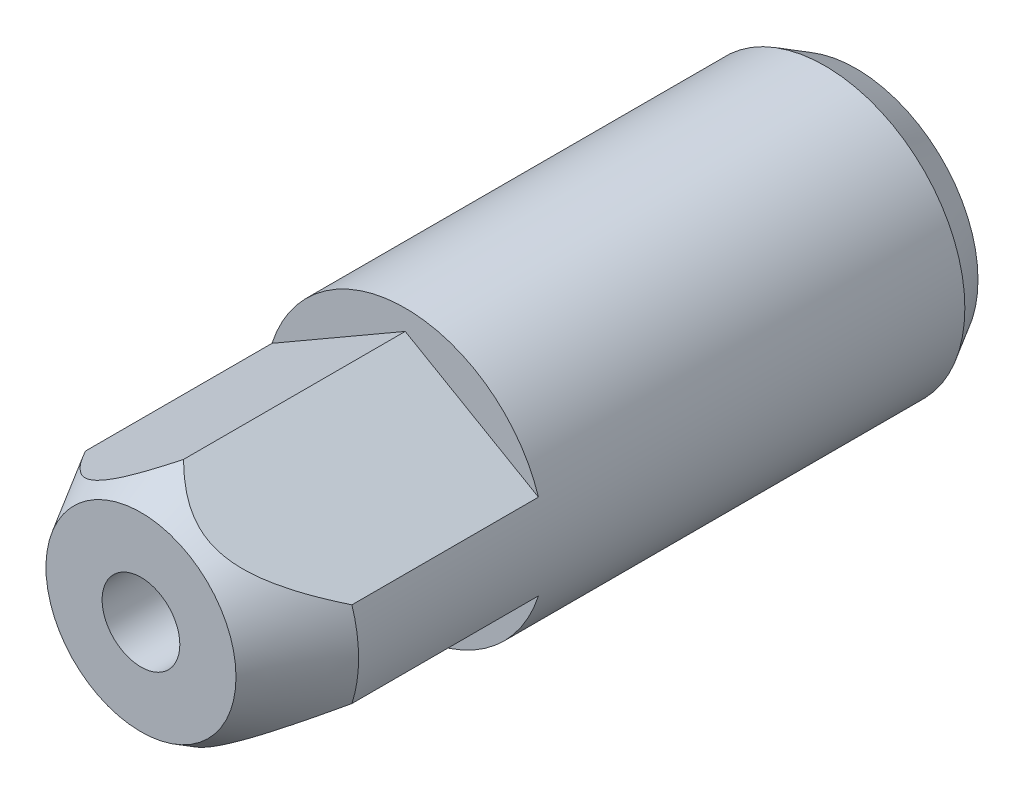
ISO-10303-21;
HEADER;
FILE_DESCRIPTION(('STEP AP214'),'2;1');
FILE_NAME('part.step','',(''),(''),'','','');
FILE_SCHEMA(('AUTOMOTIVE_DESIGN { 1 0 10303 214 1 1 1 1 }'));
ENDSEC;
DATA;
#1=APPLICATION_CONTEXT('core data for automotive mechanical design processes');
#2=APPLICATION_PROTOCOL_DEFINITION('international standard','automotive_design',2000,#1);
#3=PRODUCT_CONTEXT('',#1,'mechanical');
#4=PRODUCT('Part','Part','',(#3));
#5=PRODUCT_RELATED_PRODUCT_CATEGORY('part','',(#4));
#6=PRODUCT_DEFINITION_FORMATION('','',#4);
#7=PRODUCT_DEFINITION_CONTEXT('part definition',#1,'design');
#8=PRODUCT_DEFINITION('design','',#6,#7);
#9=PRODUCT_DEFINITION_SHAPE('','',#8);
#10=(LENGTH_UNIT() NAMED_UNIT(*) SI_UNIT(.MILLI.,.METRE.));
#11=(NAMED_UNIT(*) PLANE_ANGLE_UNIT() SI_UNIT($,.RADIAN.));
#12=(NAMED_UNIT(*) SI_UNIT($,.STERADIAN.) SOLID_ANGLE_UNIT());
#13=UNCERTAINTY_MEASURE_WITH_UNIT(LENGTH_MEASURE(1.E-05),#10,'distance_accuracy_value','');
#14=(GEOMETRIC_REPRESENTATION_CONTEXT(3) GLOBAL_UNCERTAINTY_ASSIGNED_CONTEXT((#13)) GLOBAL_UNIT_ASSIGNED_CONTEXT((#10,
#11,#12)) REPRESENTATION_CONTEXT('',''));
#15=CARTESIAN_POINT('',(0.,0.,0.));
#16=DIRECTION('',(0.,0.,1.));
#17=DIRECTION('',(1.,0.,0.));
#18=AXIS2_PLACEMENT_3D('',#15,#16,#17);
#19=CARTESIAN_POINT('',(0.,0.,41.));
#20=DIRECTION('',(0.,0.,-1.));
#21=DIRECTION('',(-1.,0.,0.));
#22=AXIS2_PLACEMENT_3D('',#19,#20,#21);
#23=CONICAL_SURFACE('',#22,9.,0.523598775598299);
#24=CARTESIAN_POINT('',(0.,0.,46.));
#25=DIRECTION('',(0.,0.,1.));
#26=DIRECTION('',(1.,0.,0.));
#27=AXIS2_PLACEMENT_3D('',#24,#25,#26);
#28=CIRCLE('',#27,6.11324865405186);
#29=CARTESIAN_POINT('',(6.11324865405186,0.,46.));
#30=VERTEX_POINT('',#29);
#31=EDGE_CURVE('E22',#30,#30,#28,.T.);
#32=ORIENTED_EDGE('',*,*,#31,.F.);
#33=EDGE_LOOP('',(#32));
#34=FACE_BOUND('',#33,.T.);
#35=CARTESIAN_POINT('',(-0.000200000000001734,7.69775800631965,43.255549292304));
#36=CARTESIAN_POINT('',(0.0695125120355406,7.65750946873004,43.3252578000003));
#37=CARTESIAN_POINT('',(0.139920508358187,7.61685939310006,43.3940367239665));
#38=CARTESIAN_POINT('',(0.28228050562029,7.53466781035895,43.5294763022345));
#39=CARTESIAN_POINT('',(0.354232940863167,7.49312605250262,43.5961363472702));
#40=CARTESIAN_POINT('',(0.573317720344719,7.3666373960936,43.7931569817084));
#41=CARTESIAN_POINT('',(0.722970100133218,7.28023555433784,43.9198420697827));
#42=CARTESIAN_POINT('',(1.03397800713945,7.10067505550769,44.1634017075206));
#43=CARTESIAN_POINT('',(1.19553740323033,7.0073986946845,44.2799323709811));
#44=CARTESIAN_POINT('',(1.52740980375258,6.81579207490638,44.4944181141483));
#45=CARTESIAN_POINT('',(1.69770236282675,6.71747362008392,44.5924142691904));
#46=CARTESIAN_POINT('',(1.9675893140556,6.56165431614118,44.7248083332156));
#47=CARTESIAN_POINT('',(2.0640232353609,6.50597816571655,44.7678335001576));
#48=CARTESIAN_POINT('',(2.25941662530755,6.39316773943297,44.8455436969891));
#49=CARTESIAN_POINT('',(2.35837627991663,6.33603335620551,44.8802281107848));
#50=CARTESIAN_POINT('',(2.5576408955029,6.22098787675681,44.9399311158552));
#51=CARTESIAN_POINT('',(2.65792902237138,6.16308649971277,44.965023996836));
#52=CARTESIAN_POINT('',(2.86001368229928,6.04641286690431,45.0050230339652));
#53=CARTESIAN_POINT('',(2.96180991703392,5.98764078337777,45.019931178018));
#54=CARTESIAN_POINT('',(3.16714105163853,5.86909279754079,45.0390571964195));
#55=CARTESIAN_POINT('',(3.27068327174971,5.8093126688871,45.0431716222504));
#56=CARTESIAN_POINT('',(3.47764571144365,5.68982284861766,45.0402333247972));
#57=CARTESIAN_POINT('',(3.5810659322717,5.63011315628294,45.0331807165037));
#58=CARTESIAN_POINT('',(3.78708902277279,5.51116566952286,45.0081896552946));
#59=CARTESIAN_POINT('',(3.88969013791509,5.45192888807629,44.9902321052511));
#60=CARTESIAN_POINT('',(4.09315492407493,5.3344584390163,44.944137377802));
#61=CARTESIAN_POINT('',(4.19401833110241,5.27622492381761,44.915998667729));
#62=CARTESIAN_POINT('',(4.42201349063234,5.14459185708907,44.8411566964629));
#63=CARTESIAN_POINT('',(4.54840420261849,5.0716201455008,44.7914453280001));
#64=CARTESIAN_POINT('',(4.79684039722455,4.92818544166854,44.6791593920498));
#65=CARTESIAN_POINT('',(4.91888315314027,4.85772402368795,44.6165769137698));
#66=CARTESIAN_POINT('',(5.15950641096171,4.71880012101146,44.480236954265));
#67=CARTESIAN_POINT('',(5.27804619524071,4.6503611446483,44.4063845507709));
#68=CARTESIAN_POINT('',(5.51065016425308,4.51606718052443,44.2499644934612));
#69=CARTESIAN_POINT('',(5.62471543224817,4.45021156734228,44.1673989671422));
#70=CARTESIAN_POINT('',(5.8754207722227,4.30546677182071,43.9746866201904));
#71=CARTESIAN_POINT('',(6.01096874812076,4.22720811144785,43.8626536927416));
#72=CARTESIAN_POINT('',(6.27655182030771,4.07387365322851,43.6301536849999));
#73=CARTESIAN_POINT('',(6.40658481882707,3.99879906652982,43.5096834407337));
#74=CARTESIAN_POINT('',(6.66215481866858,3.85124565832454,43.2618249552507));
#75=CARTESIAN_POINT('',(6.78767935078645,3.77877403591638,43.1344196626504));
#76=CARTESIAN_POINT('',(7.03455363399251,3.63624110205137,42.8743200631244));
#77=CARTESIAN_POINT('',(7.15590293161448,3.56618005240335,42.7416251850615));
#78=CARTESIAN_POINT('',(7.3891638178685,3.43150681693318,42.4785429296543));
#79=CARTESIAN_POINT('',(7.50124722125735,3.36679543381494,42.348357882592));
#80=CARTESIAN_POINT('',(7.72256910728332,3.23901518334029,42.0847929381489));
#81=CARTESIAN_POINT('',(7.83180739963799,3.1759464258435,41.9514128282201));
#82=CARTESIAN_POINT('',(8.04707385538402,3.05166227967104,41.6828894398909));
#83=CARTESIAN_POINT('',(8.15311851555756,2.99043736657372,41.547763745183));
#84=CARTESIAN_POINT('',(8.36301184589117,2.86925539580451,41.2753094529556));
#85=CARTESIAN_POINT('',(8.46686100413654,2.80929805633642,41.1379813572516));
#86=CARTESIAN_POINT('',(8.56976825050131,2.74988452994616,40.9997312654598));
#87=B_SPLINE_CURVE_WITH_KNOTS('',3,(#35,#36,#37,#38,#39,#40,#41,#42,#43,#44,#45,#46,#47,#48,#49,
#50,#51,#52,#53,#54,#55,#56,#57,#58,#59,#60,#61,#62,#63,#64,#65,#66,#67,#68,#69,#70,#71,#72,#73,
#74,#75,#76,#77,#78,#79,#80,#81,#82,#83,#84,#85,#86),.UNSPECIFIED.,.F.,.F.,(4,2,2,2,2,2,2,2,2,2,
2,2,2,2,2,2,2,2,2,2,2,2,2,2,2,4),(0.,0.319440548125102,0.638972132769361,1.28128977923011,
1.94043178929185,2.59809546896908,2.95595095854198,3.31383287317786,3.66888381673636,
4.02386543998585,4.38223703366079,4.74060493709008,5.09960224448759,5.45865361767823,
5.92043439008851,6.38249983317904,6.8486970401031,7.314780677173,7.8918478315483,
8.46913255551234,9.04790711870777,9.62674434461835,10.1773925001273,10.7280773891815,
11.2751064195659,11.8220125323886),.UNSPECIFIED.);
#88=CARTESIAN_POINT('',(0.,7.69764253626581,43.2557492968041));
#89=VERTEX_POINT('',#88);
#90=CARTESIAN_POINT('',(8.56956825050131,2.75,41.));
#91=VERTEX_POINT('',#90);
#92=EDGE_CURVE('E101',#89,#91,#87,.T.);
#93=ORIENTED_EDGE('',*,*,#92,.F.);
#94=CARTESIAN_POINT('',(0.000199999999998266,7.69775800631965,43.255549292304));
#95=CARTESIAN_POINT('',(-0.0695125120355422,7.65750946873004,43.3252578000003));
#96=CARTESIAN_POINT('',(-0.139920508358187,7.61685939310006,43.3940367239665));
#97=CARTESIAN_POINT('',(-0.282280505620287,7.53466781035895,43.5294763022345));
#98=CARTESIAN_POINT('',(-0.354232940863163,7.49312605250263,43.5961363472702));
#99=CARTESIAN_POINT('',(-0.573317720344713,7.3666373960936,43.7931569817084));
#100=CARTESIAN_POINT('',(-0.722970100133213,7.28023555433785,43.9198420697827));
#101=CARTESIAN_POINT('',(-1.03397800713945,7.10067505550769,44.1634017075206));
#102=CARTESIAN_POINT('',(-1.19553740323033,7.0073986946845,44.2799323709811));
#103=CARTESIAN_POINT('',(-1.52740980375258,6.81579207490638,44.4944181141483));
#104=CARTESIAN_POINT('',(-1.69770236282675,6.71747362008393,44.5924142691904));
#105=CARTESIAN_POINT('',(-1.96758931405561,6.56165431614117,44.7248083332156));
#106=CARTESIAN_POINT('',(-2.06402323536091,6.50597816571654,44.7678335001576));
#107=CARTESIAN_POINT('',(-2.25941662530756,6.39316773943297,44.8455436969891));
#108=CARTESIAN_POINT('',(-2.35837627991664,6.3360333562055,44.8802281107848));
#109=CARTESIAN_POINT('',(-2.55764089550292,6.2209878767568,44.9399311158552));
#110=CARTESIAN_POINT('',(-2.65792902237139,6.16308649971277,44.965023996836));
#111=CARTESIAN_POINT('',(-2.86001368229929,6.0464128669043,45.0050230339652));
#112=CARTESIAN_POINT('',(-2.96180991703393,5.98764078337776,45.019931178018));
#113=CARTESIAN_POINT('',(-3.16714105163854,5.86909279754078,45.0390571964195));
#114=CARTESIAN_POINT('',(-3.27068327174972,5.80931266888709,45.0431716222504));
#115=CARTESIAN_POINT('',(-3.47764571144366,5.68982284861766,45.0402333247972));
#116=CARTESIAN_POINT('',(-3.58106593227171,5.63011315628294,45.0331807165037));
#117=CARTESIAN_POINT('',(-3.7870890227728,5.51116566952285,45.0081896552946));
#118=CARTESIAN_POINT('',(-3.8896901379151,5.45192888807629,44.9902321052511));
#119=CARTESIAN_POINT('',(-4.09315492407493,5.3344584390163,44.944137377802));
#120=CARTESIAN_POINT('',(-4.19401833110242,5.2762249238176,44.915998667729));
#121=CARTESIAN_POINT('',(-4.42201349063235,5.14459185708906,44.8411566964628));
#122=CARTESIAN_POINT('',(-4.54840420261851,5.07162014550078,44.7914453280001));
#123=CARTESIAN_POINT('',(-4.79684039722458,4.92818544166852,44.6791593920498));
#124=CARTESIAN_POINT('',(-4.9188831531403,4.85772402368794,44.6165769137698));
#125=CARTESIAN_POINT('',(-5.15950641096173,4.71880012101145,44.480236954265));
#126=CARTESIAN_POINT('',(-5.27804619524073,4.65036114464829,44.4063845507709));
#127=CARTESIAN_POINT('',(-5.5106501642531,4.51606718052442,44.2499644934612));
#128=CARTESIAN_POINT('',(-5.62471543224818,4.45021156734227,44.1673989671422));
#129=CARTESIAN_POINT('',(-5.8754207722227,4.30546677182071,43.9746866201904));
#130=CARTESIAN_POINT('',(-6.01096874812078,4.22720811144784,43.8626536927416));
#131=CARTESIAN_POINT('',(-6.27655182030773,4.0738736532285,43.6301536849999));
#132=CARTESIAN_POINT('',(-6.40658481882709,3.99879906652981,43.5096834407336));
#133=CARTESIAN_POINT('',(-6.66215481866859,3.85124565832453,43.2618249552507));
#134=CARTESIAN_POINT('',(-6.78767935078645,3.77877403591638,43.1344196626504));
#135=CARTESIAN_POINT('',(-7.03455363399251,3.63624110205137,42.8743200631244));
#136=CARTESIAN_POINT('',(-7.15590293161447,3.56618005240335,42.7416251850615));
#137=CARTESIAN_POINT('',(-7.3891638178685,3.43150681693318,42.4785429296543));
#138=CARTESIAN_POINT('',(-7.50124722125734,3.36679543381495,42.348357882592));
#139=CARTESIAN_POINT('',(-7.7225691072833,3.2390151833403,42.0847929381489));
#140=CARTESIAN_POINT('',(-7.83180739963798,3.17594642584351,41.9514128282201));
#141=CARTESIAN_POINT('',(-8.04707385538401,3.05166227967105,41.6828894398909));
#142=CARTESIAN_POINT('',(-8.15311851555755,2.99043736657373,41.547763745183));
#143=CARTESIAN_POINT('',(-8.36301184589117,2.86925539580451,41.2753094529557));
#144=CARTESIAN_POINT('',(-8.46686100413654,2.80929805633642,41.1379813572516));
#145=CARTESIAN_POINT('',(-8.56976825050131,2.74988452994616,40.9997312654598));
#146=B_SPLINE_CURVE_WITH_KNOTS('',3,(#94,#95,#96,#97,#98,#99,#100,#101,#102,#103,#104,#105,#106,
#107,#108,#109,#110,#111,#112,#113,#114,#115,#116,#117,#118,#119,#120,#121,#122,#123,#124,#125,
#126,#127,#128,#129,#130,#131,#132,#133,#134,#135,#136,#137,#138,#139,#140,#141,#142,#143,#144,
#145),.UNSPECIFIED.,.F.,.F.,(4,2,2,2,2,2,2,2,2,2,2,2,2,2,2,2,2,2,2,2,2,2,2,2,2,4),(0.,
0.319440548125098,0.638972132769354,1.28128977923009,1.94043178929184,2.59809546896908,
2.95595095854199,3.31383287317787,3.66888381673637,4.02386543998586,4.3822370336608,
4.74060493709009,5.0996022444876,5.45865361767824,5.92043439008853,6.38249983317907,
6.84869704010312,7.31478067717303,7.89184783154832,8.46913255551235,9.04790711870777,
9.62674434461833,10.1773925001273,10.7280773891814,11.2751064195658,11.8220125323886),.UNSPECIFIED.);
#147=CARTESIAN_POINT('',(-8.56956825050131,2.75,41.));
#148=VERTEX_POINT('',#147);
#149=EDGE_CURVE('E74',#89,#148,#146,.T.);
#150=ORIENTED_EDGE('',*,*,#149,.T.);
#151=CARTESIAN_POINT('',(0.,0.,41.));
#152=DIRECTION('',(0.,0.,1.));
#153=DIRECTION('',(1.,0.,0.));
#154=AXIS2_PLACEMENT_3D('',#151,#152,#153);
#155=CIRCLE('',#154,9.);
#156=CARTESIAN_POINT('',(-8.56956825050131,-2.75,41.));
#157=VERTEX_POINT('',#156);
#158=EDGE_CURVE('E154',#148,#157,#155,.T.);
#159=ORIENTED_EDGE('',*,*,#158,.T.);
#160=CARTESIAN_POINT('',(0.000199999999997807,-7.69775800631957,43.2555492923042));
#161=CARTESIAN_POINT('',(-0.0695125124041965,-7.65750946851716,43.3252578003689));
#162=CARTESIAN_POINT('',(-0.139920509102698,-7.61685939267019,43.3940367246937));
#163=CARTESIAN_POINT('',(-0.28228050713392,-7.53466780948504,43.5294763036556));
#164=CARTESIAN_POINT('',(-0.354232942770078,-7.49312605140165,43.5961363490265));
#165=CARTESIAN_POINT('',(-0.573317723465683,-7.36663739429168,43.7931569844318));
#166=CARTESIAN_POINT('',(-0.722970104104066,-7.28023555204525,43.9198420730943));
#167=CARTESIAN_POINT('',(-1.033978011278,-7.10067505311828,44.1634017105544));
#168=CARTESIAN_POINT('',(-1.19553740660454,-7.0073986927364,44.2799323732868));
#169=CARTESIAN_POINT('',(-1.52740980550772,-6.81579207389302,44.4944181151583));
#170=CARTESIAN_POINT('',(-1.69770236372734,-6.7174736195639,44.5924142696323));
#171=CARTESIAN_POINT('',(-1.96758931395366,-6.56165431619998,44.7248083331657));
#172=CARTESIAN_POINT('',(-2.06402323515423,-6.50597816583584,44.7678335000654));
#173=CARTESIAN_POINT('',(-2.25941662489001,-6.39316773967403,44.8455436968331));
#174=CARTESIAN_POINT('',(-2.35837627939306,-6.33603335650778,44.8802281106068));
#175=CARTESIAN_POINT('',(-2.5576408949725,-6.22098787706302,44.9399311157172));
#176=CARTESIAN_POINT('',(-2.6579290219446,-6.16308649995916,44.9650239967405));
#177=CARTESIAN_POINT('',(-2.86001368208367,-6.04641286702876,45.0050230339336));
#178=CARTESIAN_POINT('',(-2.96180991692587,-5.98764078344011,45.019931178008));
#179=CARTESIAN_POINT('',(-3.16714105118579,-5.86909279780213,45.0390571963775));
#180=CARTESIAN_POINT('',(-3.27068327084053,-5.809312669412,45.0431716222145));
#181=CARTESIAN_POINT('',(-3.47764570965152,-5.68982284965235,45.0402333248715));
#182=CARTESIAN_POINT('',(-3.58106593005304,-5.63011315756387,45.0331807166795));
#183=CARTESIAN_POINT('',(-3.78708902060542,-5.51116567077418,45.008189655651));
#184=CARTESIAN_POINT('',(-3.88969013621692,-5.45192888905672,44.9902321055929));
#185=CARTESIAN_POINT('',(-4.09315492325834,-5.33445843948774,44.94413737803));
#186=CARTESIAN_POINT('',(-4.19401833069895,-5.27622492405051,44.9159986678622));
#187=CARTESIAN_POINT('',(-4.42201349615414,-5.14459185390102,44.8411566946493));
#188=CARTESIAN_POINT('',(-4.54840421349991,-5.07162013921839,44.7914453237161));
#189=CARTESIAN_POINT('',(-4.79684041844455,-4.92818542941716,44.6791593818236));
#190=CARTESIAN_POINT('',(-4.91888317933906,-4.85772400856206,44.6165769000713));
#191=CARTESIAN_POINT('',(-5.15950643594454,-4.71880010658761,44.4802369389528));
#192=CARTESIAN_POINT('',(-5.27804621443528,-4.65036113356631,44.406384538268));
#193=CARTESIAN_POINT('',(-5.51065017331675,-4.51606717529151,44.2499644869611));
#194=CARTESIAN_POINT('',(-5.62471543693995,-4.45021156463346,44.1673989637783));
#195=CARTESIAN_POINT('',(-5.87541789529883,-4.30546843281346,43.9746888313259));
#196=CARTESIAN_POINT('',(-6.01096312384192,-4.22721135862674,43.8626583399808));
#197=CARTESIAN_POINT('',(-6.27654091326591,-4.07387995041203,43.6301635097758));
#198=CARTESIAN_POINT('',(-6.40657137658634,-3.99880682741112,43.5096960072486));
#199=CARTESIAN_POINT('',(-6.66213645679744,-3.85125625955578,43.261843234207));
#200=CARTESIAN_POINT('',(-6.7876586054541,-3.77878601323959,43.1344409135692));
#201=CARTESIAN_POINT('',(-7.03452825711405,-3.63625575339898,42.8743474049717));
#202=CARTESIAN_POINT('',(-7.15587530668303,-3.56619600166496,42.7416556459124));
#203=CARTESIAN_POINT('',(-7.3891320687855,-3.43152514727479,42.478579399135));
#204=CARTESIAN_POINT('',(-7.501213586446,-3.36681485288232,42.3483972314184));
#205=CARTESIAN_POINT('',(-7.72253177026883,-3.23903673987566,42.0848381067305));
#206=CARTESIAN_POINT('',(-7.83176824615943,-3.17596903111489,41.951460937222));
#207=CARTESIAN_POINT('',(-8.04703116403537,-3.05168692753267,41.6829434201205));
#208=CARTESIAN_POINT('',(-8.15307410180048,-2.99046300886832,41.5478206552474));
#209=CARTESIAN_POINT('',(-8.3629640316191,-2.86928300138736,41.2753722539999));
#210=CARTESIAN_POINT('',(-8.46681151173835,-2.80932663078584,41.1380471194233));
#211=CARTESIAN_POINT('',(-8.56971709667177,-2.74991406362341,40.9998));
#212=B_SPLINE_CURVE_WITH_KNOTS('',3,(#160,#161,#162,#163,#164,#165,#166,#167,#168,#169,#170,
#171,#172,#173,#174,#175,#176,#177,#178,#179,#180,#181,#182,#183,#184,#185,#186,#187,#188,#189,
#190,#191,#192,#193,#194,#195,#196,#197,#198,#199,#200,#201,#202,#203,#204,#205,#206,#207,#208,
#209,#210,#211),.UNSPECIFIED.,.F.,.F.,(4,2,2,2,2,2,2,2,2,2,2,2,2,2,2,2,2,2,2,2,2,2,2,2,2,4),(0.,
0.319440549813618,0.638972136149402,1.28128978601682,1.94043179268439,2.59809546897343,
2.955950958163,3.3138328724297,3.66888381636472,4.02386543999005,4.38223703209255,
4.74060493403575,5.09960224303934,5.45865361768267,5.92043440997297,6.38249987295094,
6.84869705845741,7.31478067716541,7.89183586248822,8.4691085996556,9.04787108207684,
9.62669622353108,10.177333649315,10.7280078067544,11.2750263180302,11.821921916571),.UNSPECIFIED.);
#213=CARTESIAN_POINT('',(0.,-7.69764253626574,43.2557492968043));
#214=VERTEX_POINT('',#213);
#215=EDGE_CURVE('E128',#214,#157,#212,.T.);
#216=ORIENTED_EDGE('',*,*,#215,.F.);
#217=CARTESIAN_POINT('',(-0.000200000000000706,-7.69775800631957,43.2555492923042));
#218=CARTESIAN_POINT('',(0.0695125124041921,-7.65750946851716,43.3252578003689));
#219=CARTESIAN_POINT('',(0.139920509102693,-7.61685939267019,43.3940367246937));
#220=CARTESIAN_POINT('',(0.282280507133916,-7.53466780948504,43.5294763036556));
#221=CARTESIAN_POINT('',(0.354232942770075,-7.49312605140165,43.5961363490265));
#222=CARTESIAN_POINT('',(0.573317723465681,-7.36663739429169,43.7931569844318));
#223=CARTESIAN_POINT('',(0.722970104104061,-7.28023555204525,43.9198420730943));
#224=CARTESIAN_POINT('',(1.03397801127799,-7.10067505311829,44.1634017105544));
#225=CARTESIAN_POINT('',(1.19553740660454,-7.0073986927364,44.2799323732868));
#226=CARTESIAN_POINT('',(1.52740980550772,-6.81579207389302,44.4944181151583));
#227=CARTESIAN_POINT('',(1.69770236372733,-6.71747361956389,44.5924142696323));
#228=CARTESIAN_POINT('',(1.96758931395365,-6.56165431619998,44.7248083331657));
#229=CARTESIAN_POINT('',(2.06402323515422,-6.50597816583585,44.7678335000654));
#230=CARTESIAN_POINT('',(2.25941662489,-6.39316773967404,44.8455436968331));
#231=CARTESIAN_POINT('',(2.35837627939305,-6.33603335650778,44.8802281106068));
#232=CARTESIAN_POINT('',(2.55764089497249,-6.22098787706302,44.9399311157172));
#233=CARTESIAN_POINT('',(2.65792902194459,-6.16308649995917,44.9650239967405));
#234=CARTESIAN_POINT('',(2.86001368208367,-6.04641286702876,45.0050230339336));
#235=CARTESIAN_POINT('',(2.96180991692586,-5.98764078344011,45.019931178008));
#236=CARTESIAN_POINT('',(3.16714105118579,-5.86909279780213,45.0390571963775));
#237=CARTESIAN_POINT('',(3.27068327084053,-5.809312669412,45.0431716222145));
#238=CARTESIAN_POINT('',(3.47764570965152,-5.68982284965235,45.0402333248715));
#239=CARTESIAN_POINT('',(3.58106593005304,-5.63011315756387,45.0331807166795));
#240=CARTESIAN_POINT('',(3.78708902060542,-5.51116567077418,45.008189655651));
#241=CARTESIAN_POINT('',(3.88969013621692,-5.45192888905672,44.9902321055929));
#242=CARTESIAN_POINT('',(4.09315492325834,-5.33445843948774,44.94413737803));
#243=CARTESIAN_POINT('',(4.19401833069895,-5.27622492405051,44.9159986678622));
#244=CARTESIAN_POINT('',(4.42201349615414,-5.14459185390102,44.8411566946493));
#245=CARTESIAN_POINT('',(4.5484042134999,-5.07162013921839,44.7914453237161));
#246=CARTESIAN_POINT('',(4.79684041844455,-4.92818542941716,44.6791593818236));
#247=CARTESIAN_POINT('',(4.91888317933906,-4.85772400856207,44.6165769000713));
#248=CARTESIAN_POINT('',(5.15950643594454,-4.71880010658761,44.4802369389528));
#249=CARTESIAN_POINT('',(5.27804621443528,-4.65036113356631,44.406384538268));
#250=CARTESIAN_POINT('',(5.51065017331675,-4.51606717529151,44.2499644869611));
#251=CARTESIAN_POINT('',(5.62471543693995,-4.45021156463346,44.1673989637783));
#252=CARTESIAN_POINT('',(5.87541789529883,-4.30546843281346,43.9746888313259));
#253=CARTESIAN_POINT('',(6.01096312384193,-4.22721135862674,43.8626583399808));
#254=CARTESIAN_POINT('',(6.27654091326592,-4.07387995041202,43.6301635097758));
#255=CARTESIAN_POINT('',(6.40657137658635,-3.99880682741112,43.5096960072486));
#256=CARTESIAN_POINT('',(6.66213645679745,-3.85125625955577,43.261843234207));
#257=CARTESIAN_POINT('',(6.78765860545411,-3.77878601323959,43.1344409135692));
#258=CARTESIAN_POINT('',(7.03452825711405,-3.63625575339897,42.8743474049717));
#259=CARTESIAN_POINT('',(7.15587530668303,-3.56619600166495,42.7416556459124));
#260=CARTESIAN_POINT('',(7.38913206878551,-3.43152514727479,42.478579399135));
#261=CARTESIAN_POINT('',(7.501213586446,-3.36681485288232,42.3483972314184));
#262=CARTESIAN_POINT('',(7.72253177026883,-3.23903673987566,42.0848381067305));
#263=CARTESIAN_POINT('',(7.83176824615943,-3.17596903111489,41.951460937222));
#264=CARTESIAN_POINT('',(8.04703116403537,-3.05168692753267,41.6829434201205));
#265=CARTESIAN_POINT('',(8.15307410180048,-2.99046300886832,41.5478206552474));
#266=CARTESIAN_POINT('',(8.3629640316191,-2.86928300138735,41.2753722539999));
#267=CARTESIAN_POINT('',(8.46681151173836,-2.80932663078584,41.1380471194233));
#268=CARTESIAN_POINT('',(8.56971709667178,-2.74991406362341,40.9998));
#269=B_SPLINE_CURVE_WITH_KNOTS('',3,(#217,#218,#219,#220,#221,#222,#223,#224,#225,#226,#227,
#228,#229,#230,#231,#232,#233,#234,#235,#236,#237,#238,#239,#240,#241,#242,#243,#244,#245,#246,
#247,#248,#249,#250,#251,#252,#253,#254,#255,#256,#257,#258,#259,#260,#261,#262,#263,#264,#265,
#266,#267,#268),.UNSPECIFIED.,.F.,.F.,(4,2,2,2,2,2,2,2,2,2,2,2,2,2,2,2,2,2,2,2,2,2,2,2,2,4),(0.,
0.31944054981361,0.638972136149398,1.28128978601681,1.94043179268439,2.59809546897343,
2.95595095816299,3.3138328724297,3.66888381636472,4.02386543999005,4.38223703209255,
4.74060493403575,5.09960224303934,5.45865361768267,5.92043440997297,6.38249987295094,
6.84869705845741,7.31478067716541,7.89183586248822,8.46910859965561,9.04787108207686,
9.62669622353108,10.177333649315,10.7280078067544,11.2750263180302,11.821921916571),.UNSPECIFIED.);
#270=CARTESIAN_POINT('',(8.56956825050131,-2.75,41.));
#271=VERTEX_POINT('',#270);
#272=EDGE_CURVE('E137',#214,#271,#269,.T.);
#273=ORIENTED_EDGE('',*,*,#272,.T.);
#274=EDGE_CURVE('E155',#271,#91,#155,.T.);
#275=ORIENTED_EDGE('',*,*,#274,.T.);
#276=EDGE_LOOP('',(#93,#150,#159,#216,#273,#275));
#277=FACE_BOUND('',#276,.T.);
#278=ADVANCED_FACE('F14',(#34,#277),#23,.T.);
#279=CARTESIAN_POINT('',(0.,0.,30.));
#280=DIRECTION('',(0.,0.,1.));
#281=DIRECTION('',(1.,0.,0.));
#282=AXIS2_PLACEMENT_3D('',#279,#280,#281);
#283=CYLINDRICAL_SURFACE('',#282,9.);
#284=CARTESIAN_POINT('',(0.,0.,2.));
#285=DIRECTION('',(0.,0.,1.));
#286=DIRECTION('',(1.,0.,0.));
#287=AXIS2_PLACEMENT_3D('',#284,#285,#286);
#288=CIRCLE('',#287,9.);
#289=CARTESIAN_POINT('',(9.,0.,2.));
#290=VERTEX_POINT('',#289);
#291=EDGE_CURVE('E151',#290,#290,#288,.T.);
#292=ORIENTED_EDGE('',*,*,#291,.T.);
#293=EDGE_LOOP('',(#292));
#294=FACE_BOUND('',#293,.T.);
#295=DIRECTION('',(0.,0.,1.));
#296=VECTOR('',#295,1.);
#297=CARTESIAN_POINT('',(8.56956825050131,2.75,29.));
#298=LINE('',#297,#296);
#299=CARTESIAN_POINT('',(8.5695682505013,2.75,29.));
#300=VERTEX_POINT('',#299);
#301=EDGE_CURVE('E81',#300,#91,#298,.T.);
#302=ORIENTED_EDGE('',*,*,#301,.T.);
#303=ORIENTED_EDGE('',*,*,#274,.F.);
#304=DIRECTION('',(0.,0.,1.));
#305=VECTOR('',#304,1.);
#306=CARTESIAN_POINT('',(8.56956825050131,-2.75,29.));
#307=LINE('',#306,#305);
#308=CARTESIAN_POINT('',(8.56956825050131,-2.75,29.));
#309=VERTEX_POINT('',#308);
#310=EDGE_CURVE('E178',#309,#271,#307,.T.);
#311=ORIENTED_EDGE('',*,*,#310,.F.);
#312=CARTESIAN_POINT('',(0.,0.,29.));
#313=DIRECTION('',(0.,0.,1.));
#314=DIRECTION('',(1.,0.,0.));
#315=AXIS2_PLACEMENT_3D('',#312,#313,#314);
#316=CIRCLE('',#315,9.);
#317=CARTESIAN_POINT('',(-8.5695682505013,-2.75,29.));
#318=VERTEX_POINT('',#317);
#319=EDGE_CURVE('E168',#318,#309,#316,.T.);
#320=ORIENTED_EDGE('',*,*,#319,.F.);
#321=DIRECTION('',(0.,0.,1.));
#322=VECTOR('',#321,1.);
#323=CARTESIAN_POINT('',(-8.56956825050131,-2.75,29.));
#324=LINE('',#323,#322);
#325=EDGE_CURVE('E175',#318,#157,#324,.T.);
#326=ORIENTED_EDGE('',*,*,#325,.T.);
#327=ORIENTED_EDGE('',*,*,#158,.F.);
#328=DIRECTION('',(0.,0.,1.));
#329=VECTOR('',#328,1.);
#330=CARTESIAN_POINT('',(-8.56956825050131,2.75,29.));
#331=LINE('',#330,#329);
#332=CARTESIAN_POINT('',(-8.56956825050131,2.75,29.));
#333=VERTEX_POINT('',#332);
#334=EDGE_CURVE('E77',#333,#148,#331,.T.);
#335=ORIENTED_EDGE('',*,*,#334,.F.);
#336=CARTESIAN_POINT('',(0.,0.,29.));
#337=DIRECTION('',(0.,0.,1.));
#338=DIRECTION('',(1.,0.,0.));
#339=AXIS2_PLACEMENT_3D('',#336,#337,#338);
#340=CIRCLE('',#339,9.);
#341=EDGE_CURVE('E85',#300,#333,#340,.T.);
#342=ORIENTED_EDGE('',*,*,#341,.F.);
#343=EDGE_LOOP('',(#302,#303,#311,#320,#326,#327,#335,#342));
#344=FACE_BOUND('',#343,.T.);
#345=ADVANCED_FACE('F164',(#294,#344),#283,.T.);
#346=CARTESIAN_POINT('',(0.,0.,30.));
#347=DIRECTION('',(0.,0.,1.));
#348=DIRECTION('',(1.,0.,0.));
#349=AXIS2_PLACEMENT_3D('',#346,#347,#348);
#350=CYLINDRICAL_SURFACE('',#349,2.5);
#351=CARTESIAN_POINT('',(0.,0.,36.));
#352=DIRECTION('',(0.,0.,1.));
#353=DIRECTION('',(1.,0.,0.));
#354=AXIS2_PLACEMENT_3D('',#351,#352,#353);
#355=CIRCLE('',#354,2.5);
#356=CARTESIAN_POINT('',(2.5,0.,36.));
#357=VERTEX_POINT('',#356);
#358=EDGE_CURVE('E88',#357,#357,#355,.T.);
#359=ORIENTED_EDGE('',*,*,#358,.F.);
#360=EDGE_LOOP('',(#359));
#361=FACE_BOUND('',#360,.T.);
#362=CARTESIAN_POINT('',(0.,0.,46.));
#363=DIRECTION('',(0.,0.,1.));
#364=DIRECTION('',(1.,0.,0.));
#365=AXIS2_PLACEMENT_3D('',#362,#363,#364);
#366=CIRCLE('',#365,2.5);
#367=CARTESIAN_POINT('',(2.5,0.,46.));
#368=VERTEX_POINT('',#367);
#369=EDGE_CURVE('E9',#368,#368,#366,.T.);
#370=ORIENTED_EDGE('',*,*,#369,.T.);
#371=EDGE_LOOP('',(#370));
#372=FACE_BOUND('',#371,.T.);
#373=ADVANCED_FACE('F16',(#361,#372),#350,.F.);
#374=CARTESIAN_POINT('',(6.11324865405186,0.,46.));
#375=DIRECTION('',(0.,0.,-1.));
#376=DIRECTION('',(-1.,0.,0.));
#377=AXIS2_PLACEMENT_3D('',#374,#375,#376);
#378=PLANE('',#377);
#379=ORIENTED_EDGE('',*,*,#369,.F.);
#380=EDGE_LOOP('',(#379));
#381=FACE_BOUND('',#380,.T.);
#382=ORIENTED_EDGE('',*,*,#31,.T.);
#383=EDGE_LOOP('',(#382));
#384=FACE_BOUND('',#383,.T.);
#385=ADVANCED_FACE('F160',(#381,#384),#378,.F.);
#386=CARTESIAN_POINT('',(0.,0.,0.));
#387=DIRECTION('',(0.,0.,1.));
#388=DIRECTION('',(1.,0.,0.));
#389=AXIS2_PLACEMENT_3D('',#386,#387,#388);
#390=CONICAL_SURFACE('',#389,7.84529946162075,0.523598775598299);
#391=ORIENTED_EDGE('',*,*,#291,.F.);
#392=EDGE_LOOP('',(#391));
#393=FACE_BOUND('',#392,.T.);
#394=CARTESIAN_POINT('',(0.,0.,0.));
#395=DIRECTION('',(0.,0.,1.));
#396=DIRECTION('',(1.,0.,0.));
#397=AXIS2_PLACEMENT_3D('',#394,#395,#396);
#398=CIRCLE('',#397,7.84529946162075);
#399=CARTESIAN_POINT('',(7.84529946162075,0.,0.));
#400=VERTEX_POINT('',#399);
#401=EDGE_CURVE('E148',#400,#400,#398,.T.);
#402=ORIENTED_EDGE('',*,*,#401,.T.);
#403=EDGE_LOOP('',(#402));
#404=FACE_BOUND('',#403,.T.);
#405=ADVANCED_FACE('F251',(#393,#404),#390,.T.);
#406=CARTESIAN_POINT('',(1.,0.,0.));
#407=DIRECTION('',(0.,0.,1.));
#408=DIRECTION('',(1.,0.,0.));
#409=AXIS2_PLACEMENT_3D('',#406,#407,#408);
#410=PLANE('',#409);
#411=ORIENTED_EDGE('',*,*,#401,.F.);
#412=EDGE_LOOP('',(#411));
#413=FACE_BOUND('',#412,.T.);
#414=CARTESIAN_POINT('',(0.,0.,0.));
#415=DIRECTION('',(0.,0.,1.));
#416=DIRECTION('',(1.,0.,0.));
#417=AXIS2_PLACEMENT_3D('',#414,#415,#416);
#418=CIRCLE('',#417,1.);
#419=CARTESIAN_POINT('',(1.,0.,0.));
#420=VERTEX_POINT('',#419);
#421=EDGE_CURVE('E145',#420,#420,#418,.T.);
#422=ORIENTED_EDGE('',*,*,#421,.T.);
#423=EDGE_LOOP('',(#422));
#424=FACE_BOUND('',#423,.T.);
#425=ADVANCED_FACE('F256',(#413,#424),#410,.F.);
#426=CARTESIAN_POINT('',(0.,0.,30.));
#427=DIRECTION('',(0.,0.,1.));
#428=DIRECTION('',(1.,0.,0.));
#429=AXIS2_PLACEMENT_3D('',#426,#427,#428);
#430=CYLINDRICAL_SURFACE('',#429,1.);
#431=ORIENTED_EDGE('',*,*,#421,.F.);
#432=EDGE_LOOP('',(#431));
#433=FACE_BOUND('',#432,.T.);
#434=CARTESIAN_POINT('',(0.,0.,4.));
#435=DIRECTION('',(0.,0.,1.));
#436=DIRECTION('',(1.,0.,0.));
#437=AXIS2_PLACEMENT_3D('',#434,#435,#436);
#438=CIRCLE('',#437,1.);
#439=CARTESIAN_POINT('',(1.,0.,4.));
#440=VERTEX_POINT('',#439);
#441=EDGE_CURVE('E136',#440,#440,#438,.T.);
#442=ORIENTED_EDGE('',*,*,#441,.T.);
#443=EDGE_LOOP('',(#442));
#444=FACE_BOUND('',#443,.T.);
#445=ADVANCED_FACE('F265',(#433,#444),#430,.F.);
#446=CARTESIAN_POINT('',(0.,0.,4.));
#447=DIRECTION('',(0.,0.,1.));
#448=DIRECTION('',(1.,0.,0.));
#449=AXIS2_PLACEMENT_3D('',#446,#447,#448);
#450=PLANE('',#449);
#451=ORIENTED_EDGE('',*,*,#441,.F.);
#452=EDGE_LOOP('',(#451));
#453=FACE_BOUND('',#452,.T.);
#454=ADVANCED_FACE('F123',(#453),#450,.F.);
#455=CARTESIAN_POINT('',(-8.56956825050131,-2.75,29.));
#456=DIRECTION('',(-0.5,-0.866025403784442,0.));
#457=DIRECTION('',(0.866025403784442,-0.5,0.));
#458=AXIS2_PLACEMENT_3D('',#455,#456,#457);
#459=PLANE('',#458);
#460=ORIENTED_EDGE('',*,*,#215,.T.);
#461=ORIENTED_EDGE('',*,*,#325,.F.);
#462=DIRECTION('',(0.866025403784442,-0.5,0.));
#463=VECTOR('',#462,1.);
#464=CARTESIAN_POINT('',(-8.56956825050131,-2.75,29.));
#465=LINE('',#464,#463);
#466=CARTESIAN_POINT('',(0.,-7.69764253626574,29.));
#467=VERTEX_POINT('',#466);
#468=EDGE_CURVE('E37',#318,#467,#465,.T.);
#469=ORIENTED_EDGE('',*,*,#468,.T.);
#470=DIRECTION('',(0.,0.,1.));
#471=VECTOR('',#470,1.);
#472=CARTESIAN_POINT('',(0.,-7.69764253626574,29.));
#473=LINE('',#472,#471);
#474=EDGE_CURVE('E179',#467,#214,#473,.T.);
#475=ORIENTED_EDGE('',*,*,#474,.T.);
#476=EDGE_LOOP('',(#460,#461,#469,#475));
#477=FACE_BOUND('',#476,.T.);
#478=ADVANCED_FACE('F119',(#477),#459,.T.);
#479=CARTESIAN_POINT('',(8.56956825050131,-2.75,29.));
#480=DIRECTION('',(-0.5,0.866025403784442,0.));
#481=DIRECTION('',(-0.866025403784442,-0.5,0.));
#482=AXIS2_PLACEMENT_3D('',#479,#480,#481);
#483=PLANE('',#482);
#484=ORIENTED_EDGE('',*,*,#474,.F.);
#485=DIRECTION('',(-0.866025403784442,-0.5,0.));
#486=VECTOR('',#485,1.);
#487=CARTESIAN_POINT('',(8.56956825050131,-2.75,29.));
#488=LINE('',#487,#486);
#489=EDGE_CURVE('E169',#309,#467,#488,.T.);
#490=ORIENTED_EDGE('',*,*,#489,.F.);
#491=ORIENTED_EDGE('',*,*,#310,.T.);
#492=ORIENTED_EDGE('',*,*,#272,.F.);
#493=EDGE_LOOP('',(#484,#490,#491,#492));
#494=FACE_BOUND('',#493,.T.);
#495=ADVANCED_FACE('F118',(#494),#483,.F.);
#496=CARTESIAN_POINT('',(0.,0.,29.));
#497=DIRECTION('',(0.,0.,1.));
#498=DIRECTION('',(1.,0.,0.));
#499=AXIS2_PLACEMENT_3D('',#496,#497,#498);
#500=PLANE('',#499);
#501=ORIENTED_EDGE('',*,*,#468,.F.);
#502=ORIENTED_EDGE('',*,*,#319,.T.);
#503=ORIENTED_EDGE('',*,*,#489,.T.);
#504=EDGE_LOOP('',(#501,#502,#503));
#505=FACE_BOUND('',#504,.T.);
#506=ADVANCED_FACE('F115',(#505),#500,.T.);
#507=CARTESIAN_POINT('',(8.56956825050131,2.75,29.));
#508=DIRECTION('',(0.5,0.866025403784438,0.));
#509=DIRECTION('',(-0.866025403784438,0.5,0.));
#510=AXIS2_PLACEMENT_3D('',#507,#508,#509);
#511=PLANE('',#510);
#512=ORIENTED_EDGE('',*,*,#92,.T.);
#513=ORIENTED_EDGE('',*,*,#301,.F.);
#514=DIRECTION('',(-0.866025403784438,0.5,0.));
#515=VECTOR('',#514,1.);
#516=CARTESIAN_POINT('',(8.56956825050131,2.75,29.));
#517=LINE('',#516,#515);
#518=CARTESIAN_POINT('',(0.,7.69764253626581,29.));
#519=VERTEX_POINT('',#518);
#520=EDGE_CURVE('E29',#300,#519,#517,.T.);
#521=ORIENTED_EDGE('',*,*,#520,.T.);
#522=DIRECTION('',(0.,0.,1.));
#523=VECTOR('',#522,1.);
#524=CARTESIAN_POINT('',(0.,7.69764253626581,29.));
#525=LINE('',#524,#523);
#526=EDGE_CURVE('E70',#519,#89,#525,.T.);
#527=ORIENTED_EDGE('',*,*,#526,.T.);
#528=EDGE_LOOP('',(#512,#513,#521,#527));
#529=FACE_BOUND('',#528,.T.);
#530=ADVANCED_FACE('F79',(#529),#511,.T.);
#531=CARTESIAN_POINT('',(-8.56956825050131,2.75,29.));
#532=DIRECTION('',(0.5,-0.866025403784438,0.));
#533=DIRECTION('',(0.866025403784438,0.5,0.));
#534=AXIS2_PLACEMENT_3D('',#531,#532,#533);
#535=PLANE('',#534);
#536=ORIENTED_EDGE('',*,*,#526,.F.);
#537=DIRECTION('',(0.866025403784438,0.5,0.));
#538=VECTOR('',#537,1.);
#539=CARTESIAN_POINT('',(-8.56956825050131,2.75,29.));
#540=LINE('',#539,#538);
#541=EDGE_CURVE('E72',#333,#519,#540,.T.);
#542=ORIENTED_EDGE('',*,*,#541,.F.);
#543=ORIENTED_EDGE('',*,*,#334,.T.);
#544=ORIENTED_EDGE('',*,*,#149,.F.);
#545=EDGE_LOOP('',(#536,#542,#543,#544));
#546=FACE_BOUND('',#545,.T.);
#547=ADVANCED_FACE('F71',(#546),#535,.F.);
#548=CARTESIAN_POINT('',(0.,0.,29.));
#549=DIRECTION('',(0.,0.,1.));
#550=DIRECTION('',(1.,0.,0.));
#551=AXIS2_PLACEMENT_3D('',#548,#549,#550);
#552=PLANE('',#551);
#553=ORIENTED_EDGE('',*,*,#520,.F.);
#554=ORIENTED_EDGE('',*,*,#341,.T.);
#555=ORIENTED_EDGE('',*,*,#541,.T.);
#556=EDGE_LOOP('',(#553,#554,#555));
#557=FACE_BOUND('',#556,.T.);
#558=ADVANCED_FACE('F84',(#557),#552,.T.);
#559=CARTESIAN_POINT('',(0.,0.,36.));
#560=DIRECTION('',(0.,0.,1.));
#561=DIRECTION('',(1.,0.,0.));
#562=AXIS2_PLACEMENT_3D('',#559,#560,#561);
#563=PLANE('',#562);
#564=ORIENTED_EDGE('',*,*,#358,.T.);
#565=EDGE_LOOP('',(#564));
#566=FACE_BOUND('',#565,.T.);
#567=ADVANCED_FACE('F216',(#566),#563,.T.);
#568=CLOSED_SHELL('',(#278,#345,#373,#385,#405,#425,#445,#454,#478,#495,#506,#530,#547,#558,#567));
#569=MANIFOLD_SOLID_BREP('B1',#568);
#570=ADVANCED_BREP_SHAPE_REPRESENTATION('',(#18,#569),#14);
#571=SHAPE_DEFINITION_REPRESENTATION(#9,#570);
ENDSEC;
END-ISO-10303-21;
